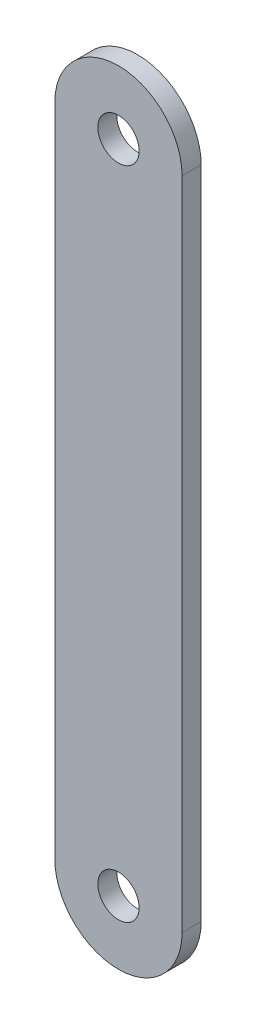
ISO-10303-21;
HEADER;
FILE_DESCRIPTION(('STEP AP214'),'2;1');
FILE_NAME('part.step','',(''),(''),'','','');
FILE_SCHEMA(('AUTOMOTIVE_DESIGN { 1 0 10303 214 1 1 1 1 }'));
ENDSEC;
DATA;
#1=APPLICATION_CONTEXT('core data for automotive mechanical design processes');
#2=APPLICATION_PROTOCOL_DEFINITION('international standard','automotive_design',2000,#1);
#3=PRODUCT_CONTEXT('',#1,'mechanical');
#4=PRODUCT('Part','Part','',(#3));
#5=PRODUCT_RELATED_PRODUCT_CATEGORY('part','',(#4));
#6=PRODUCT_DEFINITION_FORMATION('','',#4);
#7=PRODUCT_DEFINITION_CONTEXT('part definition',#1,'design');
#8=PRODUCT_DEFINITION('design','',#6,#7);
#9=PRODUCT_DEFINITION_SHAPE('','',#8);
#10=(LENGTH_UNIT() NAMED_UNIT(*) SI_UNIT(.MILLI.,.METRE.));
#11=(NAMED_UNIT(*) PLANE_ANGLE_UNIT() SI_UNIT($,.RADIAN.));
#12=(NAMED_UNIT(*) SI_UNIT($,.STERADIAN.) SOLID_ANGLE_UNIT());
#13=UNCERTAINTY_MEASURE_WITH_UNIT(LENGTH_MEASURE(1.E-05),#10,'distance_accuracy_value','');
#14=(GEOMETRIC_REPRESENTATION_CONTEXT(3) GLOBAL_UNCERTAINTY_ASSIGNED_CONTEXT((#13)) GLOBAL_UNIT_ASSIGNED_CONTEXT((#10,
#11,#12)) REPRESENTATION_CONTEXT('',''));
#15=CARTESIAN_POINT('',(0.,0.,0.));
#16=DIRECTION('',(0.,0.,1.));
#17=DIRECTION('',(1.,0.,0.));
#18=AXIS2_PLACEMENT_3D('',#15,#16,#17);
#19=CARTESIAN_POINT('',(0.,0.,3.));
#20=DIRECTION('',(0.,0.,-1.));
#21=DIRECTION('',(-1.,0.,0.));
#22=AXIS2_PLACEMENT_3D('',#19,#20,#21);
#23=PLANE('',#22);
#24=CARTESIAN_POINT('',(0.,103.,3.));
#25=DIRECTION('',(0.,0.,1.));
#26=DIRECTION('',(1.,0.,0.));
#27=AXIS2_PLACEMENT_3D('',#24,#25,#26);
#28=CIRCLE('',#27,3.25);
#29=CARTESIAN_POINT('',(3.25,103.,3.));
#30=VERTEX_POINT('',#29);
#31=EDGE_CURVE('E97',#30,#30,#28,.T.);
#32=ORIENTED_EDGE('',*,*,#31,.F.);
#33=EDGE_LOOP('',(#32));
#34=FACE_BOUND('',#33,.T.);
#35=CARTESIAN_POINT('',(0.,0.,3.));
#36=DIRECTION('',(0.,0.,1.));
#37=DIRECTION('',(-1.,0.,0.));
#38=AXIS2_PLACEMENT_3D('',#35,#36,#37);
#39=CIRCLE('',#38,10.);
#40=CARTESIAN_POINT('',(-10.,0.,3.));
#41=VERTEX_POINT('',#40);
#42=CARTESIAN_POINT('',(10.,0.,3.));
#43=VERTEX_POINT('',#42);
#44=EDGE_CURVE('E82',#41,#43,#39,.T.);
#45=ORIENTED_EDGE('',*,*,#44,.T.);
#46=DIRECTION('',(0.,1.,0.));
#47=VECTOR('',#46,1.);
#48=CARTESIAN_POINT('',(10.,0.,3.));
#49=LINE('',#48,#47);
#50=CARTESIAN_POINT('',(10.,103.,3.));
#51=VERTEX_POINT('',#50);
#52=EDGE_CURVE('E77',#43,#51,#49,.T.);
#53=ORIENTED_EDGE('',*,*,#52,.T.);
#54=CARTESIAN_POINT('',(0.,103.,3.));
#55=DIRECTION('',(0.,0.,1.));
#56=DIRECTION('',(1.,0.,0.));
#57=AXIS2_PLACEMENT_3D('',#54,#55,#56);
#58=CIRCLE('',#57,10.);
#59=CARTESIAN_POINT('',(-10.,103.,3.));
#60=VERTEX_POINT('',#59);
#61=EDGE_CURVE('E80',#51,#60,#58,.T.);
#62=ORIENTED_EDGE('',*,*,#61,.T.);
#63=DIRECTION('',(0.,-1.,0.));
#64=VECTOR('',#63,1.);
#65=CARTESIAN_POINT('',(-10.,0.,3.));
#66=LINE('',#65,#64);
#67=EDGE_CURVE('E47',#60,#41,#66,.T.);
#68=ORIENTED_EDGE('',*,*,#67,.T.);
#69=EDGE_LOOP('',(#45,#53,#62,#68));
#70=FACE_BOUND('',#69,.T.);
#71=CARTESIAN_POINT('',(0.,0.,3.));
#72=DIRECTION('',(0.,0.,1.));
#73=DIRECTION('',(1.,0.,0.));
#74=AXIS2_PLACEMENT_3D('',#71,#72,#73);
#75=CIRCLE('',#74,3.25);
#76=CARTESIAN_POINT('',(3.25,0.,3.));
#77=VERTEX_POINT('',#76);
#78=EDGE_CURVE('E112',#77,#77,#75,.T.);
#79=ORIENTED_EDGE('',*,*,#78,.F.);
#80=EDGE_LOOP('',(#79));
#81=FACE_BOUND('',#80,.T.);
#82=ADVANCED_FACE('F30',(#34,#70,#81),#23,.F.);
#83=CARTESIAN_POINT('',(0.,0.,0.));
#84=DIRECTION('',(0.,0.,-1.));
#85=DIRECTION('',(-1.,0.,0.));
#86=AXIS2_PLACEMENT_3D('',#83,#84,#85);
#87=PLANE('',#86);
#88=CARTESIAN_POINT('',(0.,103.,0.));
#89=DIRECTION('',(0.,0.,1.));
#90=DIRECTION('',(1.,0.,0.));
#91=AXIS2_PLACEMENT_3D('',#88,#89,#90);
#92=CIRCLE('',#91,3.25);
#93=CARTESIAN_POINT('',(3.25,103.,0.));
#94=VERTEX_POINT('',#93);
#95=EDGE_CURVE('E109',#94,#94,#92,.T.);
#96=ORIENTED_EDGE('',*,*,#95,.T.);
#97=EDGE_LOOP('',(#96));
#98=FACE_BOUND('',#97,.T.);
#99=CARTESIAN_POINT('',(0.,0.,0.));
#100=DIRECTION('',(0.,0.,1.));
#101=DIRECTION('',(-1.,0.,0.));
#102=AXIS2_PLACEMENT_3D('',#99,#100,#101);
#103=CIRCLE('',#102,10.);
#104=CARTESIAN_POINT('',(-10.,0.,0.));
#105=VERTEX_POINT('',#104);
#106=CARTESIAN_POINT('',(10.,0.,0.));
#107=VERTEX_POINT('',#106);
#108=EDGE_CURVE('E94',#105,#107,#103,.T.);
#109=ORIENTED_EDGE('',*,*,#108,.F.);
#110=DIRECTION('',(0.,-1.,0.));
#111=VECTOR('',#110,1.);
#112=CARTESIAN_POINT('',(-10.,0.,0.));
#113=LINE('',#112,#111);
#114=CARTESIAN_POINT('',(-10.,103.,0.));
#115=VERTEX_POINT('',#114);
#116=EDGE_CURVE('E70',#115,#105,#113,.T.);
#117=ORIENTED_EDGE('',*,*,#116,.F.);
#118=CARTESIAN_POINT('',(0.,103.,0.));
#119=DIRECTION('',(0.,0.,1.));
#120=DIRECTION('',(1.,0.,0.));
#121=AXIS2_PLACEMENT_3D('',#118,#119,#120);
#122=CIRCLE('',#121,10.);
#123=CARTESIAN_POINT('',(10.,103.,0.));
#124=VERTEX_POINT('',#123);
#125=EDGE_CURVE('E64',#124,#115,#122,.T.);
#126=ORIENTED_EDGE('',*,*,#125,.F.);
#127=DIRECTION('',(0.,1.,0.));
#128=VECTOR('',#127,1.);
#129=CARTESIAN_POINT('',(10.,0.,0.));
#130=LINE('',#129,#128);
#131=EDGE_CURVE('E86',#107,#124,#130,.T.);
#132=ORIENTED_EDGE('',*,*,#131,.F.);
#133=EDGE_LOOP('',(#109,#117,#126,#132));
#134=FACE_BOUND('',#133,.T.);
#135=CARTESIAN_POINT('',(0.,0.,0.));
#136=DIRECTION('',(0.,0.,1.));
#137=DIRECTION('',(1.,0.,0.));
#138=AXIS2_PLACEMENT_3D('',#135,#136,#137);
#139=CIRCLE('',#138,3.25);
#140=CARTESIAN_POINT('',(3.25,0.,0.));
#141=VERTEX_POINT('',#140);
#142=EDGE_CURVE('E115',#141,#141,#139,.T.);
#143=ORIENTED_EDGE('',*,*,#142,.T.);
#144=EDGE_LOOP('',(#143));
#145=FACE_BOUND('',#144,.T.);
#146=ADVANCED_FACE('F105',(#98,#134,#145),#87,.T.);
#147=CARTESIAN_POINT('',(0.,0.,3.));
#148=DIRECTION('',(0.,0.,-1.));
#149=DIRECTION('',(-1.,0.,0.));
#150=AXIS2_PLACEMENT_3D('',#147,#148,#149);
#151=CYLINDRICAL_SURFACE('',#150,10.);
#152=ORIENTED_EDGE('',*,*,#108,.T.);
#153=DIRECTION('',(0.,0.,-1.));
#154=VECTOR('',#153,1.);
#155=CARTESIAN_POINT('',(10.,0.,3.));
#156=LINE('',#155,#154);
#157=EDGE_CURVE('E11',#43,#107,#156,.T.);
#158=ORIENTED_EDGE('',*,*,#157,.F.);
#159=ORIENTED_EDGE('',*,*,#44,.F.);
#160=DIRECTION('',(0.,0.,-1.));
#161=VECTOR('',#160,1.);
#162=CARTESIAN_POINT('',(-10.,0.,3.));
#163=LINE('',#162,#161);
#164=EDGE_CURVE('E90',#41,#105,#163,.T.);
#165=ORIENTED_EDGE('',*,*,#164,.T.);
#166=EDGE_LOOP('',(#152,#158,#159,#165));
#167=FACE_BOUND('',#166,.T.);
#168=ADVANCED_FACE('F32',(#167),#151,.T.);
#169=CARTESIAN_POINT('',(10.,0.,3.));
#170=DIRECTION('',(-1.,0.,0.));
#171=DIRECTION('',(0.,0.,1.));
#172=AXIS2_PLACEMENT_3D('',#169,#170,#171);
#173=PLANE('',#172);
#174=ORIENTED_EDGE('',*,*,#131,.T.);
#175=DIRECTION('',(0.,0.,-1.));
#176=VECTOR('',#175,1.);
#177=CARTESIAN_POINT('',(10.,103.,3.));
#178=LINE('',#177,#176);
#179=EDGE_CURVE('E39',#51,#124,#178,.T.);
#180=ORIENTED_EDGE('',*,*,#179,.F.);
#181=ORIENTED_EDGE('',*,*,#52,.F.);
#182=ORIENTED_EDGE('',*,*,#157,.T.);
#183=EDGE_LOOP('',(#174,#180,#181,#182));
#184=FACE_BOUND('',#183,.T.);
#185=ADVANCED_FACE('F85',(#184),#173,.F.);
#186=CARTESIAN_POINT('',(0.,103.,3.));
#187=DIRECTION('',(0.,0.,-1.));
#188=DIRECTION('',(-1.,0.,0.));
#189=AXIS2_PLACEMENT_3D('',#186,#187,#188);
#190=CYLINDRICAL_SURFACE('',#189,10.);
#191=ORIENTED_EDGE('',*,*,#125,.T.);
#192=DIRECTION('',(0.,0.,-1.));
#193=VECTOR('',#192,1.);
#194=CARTESIAN_POINT('',(-10.,103.,3.));
#195=LINE('',#194,#193);
#196=EDGE_CURVE('E87',#60,#115,#195,.T.);
#197=ORIENTED_EDGE('',*,*,#196,.F.);
#198=ORIENTED_EDGE('',*,*,#61,.F.);
#199=ORIENTED_EDGE('',*,*,#179,.T.);
#200=EDGE_LOOP('',(#191,#197,#198,#199));
#201=FACE_BOUND('',#200,.T.);
#202=ADVANCED_FACE('F88',(#201),#190,.T.);
#203=CARTESIAN_POINT('',(-10.,0.,3.));
#204=DIRECTION('',(1.,0.,0.));
#205=DIRECTION('',(0.,0.,-1.));
#206=AXIS2_PLACEMENT_3D('',#203,#204,#205);
#207=PLANE('',#206);
#208=ORIENTED_EDGE('',*,*,#116,.T.);
#209=ORIENTED_EDGE('',*,*,#164,.F.);
#210=ORIENTED_EDGE('',*,*,#67,.F.);
#211=ORIENTED_EDGE('',*,*,#196,.T.);
#212=EDGE_LOOP('',(#208,#209,#210,#211));
#213=FACE_BOUND('',#212,.T.);
#214=ADVANCED_FACE('F102',(#213),#207,.F.);
#215=CARTESIAN_POINT('',(0.,103.,3.));
#216=DIRECTION('',(0.,0.,-1.));
#217=DIRECTION('',(-1.,0.,0.));
#218=AXIS2_PLACEMENT_3D('',#215,#216,#217);
#219=CYLINDRICAL_SURFACE('',#218,3.25);
#220=ORIENTED_EDGE('',*,*,#31,.T.);
#221=EDGE_LOOP('',(#220));
#222=FACE_BOUND('',#221,.T.);
#223=ORIENTED_EDGE('',*,*,#95,.F.);
#224=EDGE_LOOP('',(#223));
#225=FACE_BOUND('',#224,.T.);
#226=ADVANCED_FACE('F133',(#222,#225),#219,.F.);
#227=CARTESIAN_POINT('',(0.,0.,3.));
#228=DIRECTION('',(0.,0.,-1.));
#229=DIRECTION('',(-1.,0.,0.));
#230=AXIS2_PLACEMENT_3D('',#227,#228,#229);
#231=CYLINDRICAL_SURFACE('',#230,3.25);
#232=ORIENTED_EDGE('',*,*,#78,.T.);
#233=EDGE_LOOP('',(#232));
#234=FACE_BOUND('',#233,.T.);
#235=ORIENTED_EDGE('',*,*,#142,.F.);
#236=EDGE_LOOP('',(#235));
#237=FACE_BOUND('',#236,.T.);
#238=ADVANCED_FACE('F121',(#234,#237),#231,.F.);
#239=CLOSED_SHELL('',(#82,#146,#168,#185,#202,#214,#226,#238));
#240=MANIFOLD_SOLID_BREP('B2',#239);
#241=ADVANCED_BREP_SHAPE_REPRESENTATION('',(#18,#240),#14);
#242=SHAPE_DEFINITION_REPRESENTATION(#9,#241);
ENDSEC;
END-ISO-10303-21;
